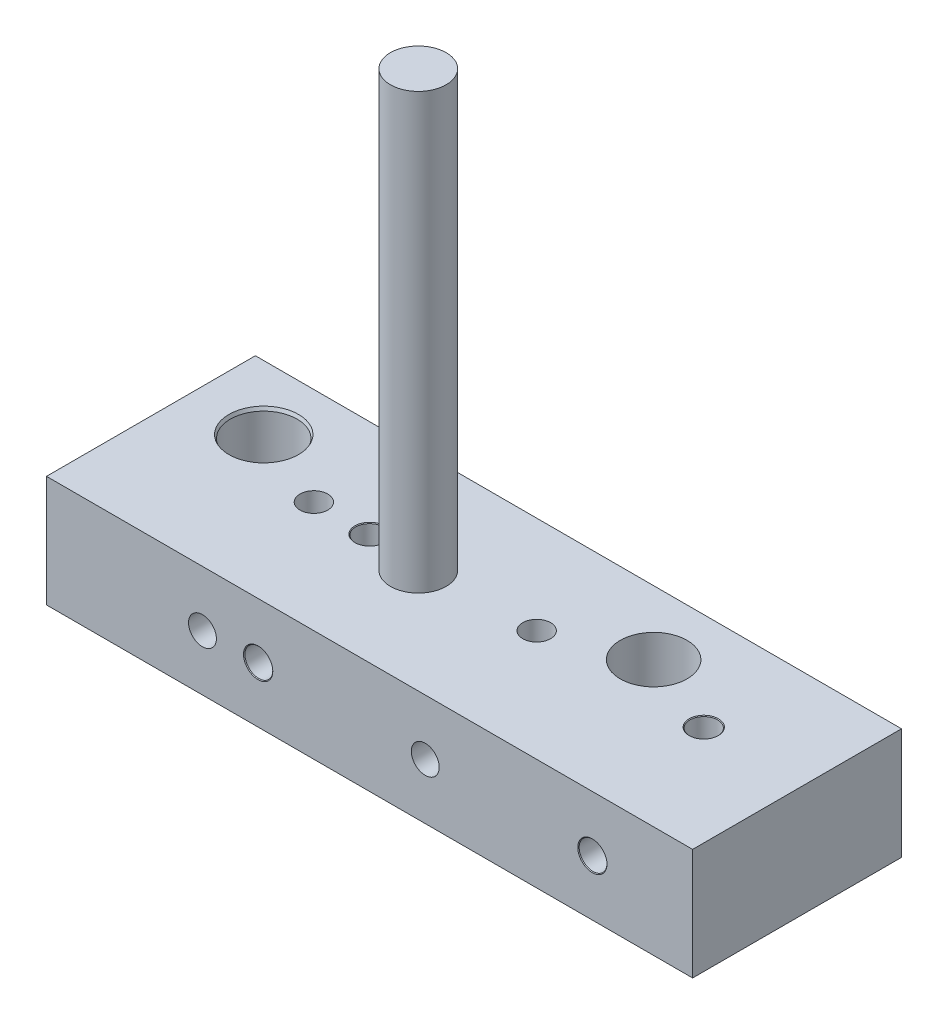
ISO-10303-21;
HEADER;
FILE_DESCRIPTION(('STEP AP214'),'2;1');
FILE_NAME('part.step','',(''),(''),'','','');
FILE_SCHEMA(('AUTOMOTIVE_DESIGN { 1 0 10303 214 1 1 1 1 }'));
ENDSEC;
DATA;
#1=APPLICATION_CONTEXT('core data for automotive mechanical design processes');
#2=APPLICATION_PROTOCOL_DEFINITION('international standard','automotive_design',2000,#1);
#3=PRODUCT_CONTEXT('',#1,'mechanical');
#4=PRODUCT('Part','Part','',(#3));
#5=PRODUCT_RELATED_PRODUCT_CATEGORY('part','',(#4));
#6=PRODUCT_DEFINITION_FORMATION('','',#4);
#7=PRODUCT_DEFINITION_CONTEXT('part definition',#1,'design');
#8=PRODUCT_DEFINITION('design','',#6,#7);
#9=PRODUCT_DEFINITION_SHAPE('','',#8);
#10=(LENGTH_UNIT() NAMED_UNIT(*) SI_UNIT(.MILLI.,.METRE.));
#11=(NAMED_UNIT(*) PLANE_ANGLE_UNIT() SI_UNIT($,.RADIAN.));
#12=(NAMED_UNIT(*) SI_UNIT($,.STERADIAN.) SOLID_ANGLE_UNIT());
#13=UNCERTAINTY_MEASURE_WITH_UNIT(LENGTH_MEASURE(1.E-05),#10,'distance_accuracy_value','');
#14=(GEOMETRIC_REPRESENTATION_CONTEXT(3) GLOBAL_UNCERTAINTY_ASSIGNED_CONTEXT((#13)) GLOBAL_UNIT_ASSIGNED_CONTEXT((#10,
#11,#12)) REPRESENTATION_CONTEXT('',''));
#15=CARTESIAN_POINT('',(0.,0.,0.));
#16=DIRECTION('',(0.,0.,1.));
#17=DIRECTION('',(1.,0.,0.));
#18=AXIS2_PLACEMENT_3D('',#15,#16,#17);
#19=CARTESIAN_POINT('',(0.,20.,-37.5));
#20=DIRECTION('',(0.,-1.,0.));
#21=DIRECTION('',(0.,0.,-1.));
#22=AXIS2_PLACEMENT_3D('',#19,#20,#21);
#23=PLANE('',#22);
#24=CARTESIAN_POINT('',(83.,20.,-26.));
#25=DIRECTION('',(0.,-1.,0.));
#26=DIRECTION('',(0.,0.,-1.));
#27=AXIS2_PLACEMENT_3D('',#24,#25,#26);
#28=CIRCLE('',#27,5.99999999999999);
#29=CARTESIAN_POINT('',(83.,20.,-32.));
#30=VERTEX_POINT('',#29);
#31=EDGE_CURVE('E9178',#30,#30,#28,.T.);
#32=ORIENTED_EDGE('',*,*,#31,.T.);
#33=EDGE_LOOP('',(#32));
#34=FACE_BOUND('',#33,.T.);
#35=DIRECTION('',(0.,0.,1.));
#36=VECTOR('',#35,1.);
#37=CARTESIAN_POINT('',(0.,20.,0.));
#38=LINE('',#37,#36);
#39=CARTESIAN_POINT('',(0.,20.,-37.5));
#40=VERTEX_POINT('',#39);
#41=CARTESIAN_POINT('',(0.,20.,0.));
#42=VERTEX_POINT('',#41);
#43=EDGE_CURVE('E9306',#40,#42,#38,.T.);
#44=ORIENTED_EDGE('',*,*,#43,.T.);
#45=DIRECTION('',(1.,0.,0.));
#46=VECTOR('',#45,1.);
#47=CARTESIAN_POINT('',(0.,20.,0.));
#48=LINE('',#47,#46);
#49=CARTESIAN_POINT('',(116.,20.,0.));
#50=VERTEX_POINT('',#49);
#51=EDGE_CURVE('E9304',#42,#50,#48,.T.);
#52=ORIENTED_EDGE('',*,*,#51,.T.);
#53=DIRECTION('',(0.,0.,-1.));
#54=VECTOR('',#53,1.);
#55=CARTESIAN_POINT('',(116.,20.,0.));
#56=LINE('',#55,#54);
#57=CARTESIAN_POINT('',(116.,20.,-37.5));
#58=VERTEX_POINT('',#57);
#59=EDGE_CURVE('E9302',#50,#58,#56,.T.);
#60=ORIENTED_EDGE('',*,*,#59,.T.);
#61=DIRECTION('',(-1.,0.,0.));
#62=VECTOR('',#61,1.);
#63=CARTESIAN_POINT('',(0.,20.,-37.5));
#64=LINE('',#63,#62);
#65=EDGE_CURVE('E9300',#58,#40,#64,.T.);
#66=ORIENTED_EDGE('',*,*,#65,.T.);
#67=EDGE_LOOP('',(#44,#52,#60,#66));
#68=FACE_BOUND('',#67,.T.);
#69=CARTESIAN_POINT('',(13.,20.,-26.));
#70=DIRECTION('',(0.,-1.,0.));
#71=DIRECTION('',(0.,0.,-1.));
#72=AXIS2_PLACEMENT_3D('',#69,#70,#71);
#73=CIRCLE('',#72,6.25);
#74=CARTESIAN_POINT('',(13.,20.,-32.25));
#75=VERTEX_POINT('',#74);
#76=EDGE_CURVE('E9327',#75,#75,#73,.T.);
#77=ORIENTED_EDGE('',*,*,#76,.T.);
#78=EDGE_LOOP('',(#77));
#79=FACE_BOUND('',#78,.T.);
#80=CARTESIAN_POINT('',(28.,20.,-20.));
#81=DIRECTION('',(0.,-1.,0.));
#82=DIRECTION('',(0.,0.,-1.));
#83=AXIS2_PLACEMENT_3D('',#80,#81,#82);
#84=CIRCLE('',#83,2.5);
#85=CARTESIAN_POINT('',(28.,20.,-22.5));
#86=VERTEX_POINT('',#85);
#87=EDGE_CURVE('E9333',#86,#86,#84,.T.);
#88=ORIENTED_EDGE('',*,*,#87,.T.);
#89=EDGE_LOOP('',(#88));
#90=FACE_BOUND('',#89,.T.);
#91=CARTESIAN_POINT('',(68.,20.,-20.));
#92=DIRECTION('',(0.,-1.,0.));
#93=DIRECTION('',(0.,0.,-1.));
#94=AXIS2_PLACEMENT_3D('',#91,#92,#93);
#95=CIRCLE('',#94,2.5);
#96=CARTESIAN_POINT('',(68.,20.,-22.5));
#97=VERTEX_POINT('',#96);
#98=EDGE_CURVE('E9339',#97,#97,#95,.T.);
#99=ORIENTED_EDGE('',*,*,#98,.T.);
#100=EDGE_LOOP('',(#99));
#101=FACE_BOUND('',#100,.T.);
#102=CARTESIAN_POINT('',(38.,20.,-20.));
#103=DIRECTION('',(0.,-1.,0.));
#104=DIRECTION('',(0.,0.,-1.));
#105=AXIS2_PLACEMENT_3D('',#102,#103,#104);
#106=CIRCLE('',#105,2.625);
#107=CARTESIAN_POINT('',(38.,20.,-22.625));
#108=VERTEX_POINT('',#107);
#109=EDGE_CURVE('E9351',#108,#108,#106,.T.);
#110=ORIENTED_EDGE('',*,*,#109,.T.);
#111=EDGE_LOOP('',(#110));
#112=FACE_BOUND('',#111,.T.);
#113=CARTESIAN_POINT('',(98.,20.,-20.));
#114=DIRECTION('',(0.,-1.,0.));
#115=DIRECTION('',(0.,0.,-1.));
#116=AXIS2_PLACEMENT_3D('',#113,#114,#115);
#117=CIRCLE('',#116,2.62499999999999);
#118=CARTESIAN_POINT('',(98.,20.,-22.625));
#119=VERTEX_POINT('',#118);
#120=EDGE_CURVE('E9363',#119,#119,#117,.T.);
#121=ORIENTED_EDGE('',*,*,#120,.T.);
#122=EDGE_LOOP('',(#121));
#123=FACE_BOUND('',#122,.T.);
#124=CARTESIAN_POINT('',(48.,20.,-18.75));
#125=DIRECTION('',(0.,-1.,0.));
#126=DIRECTION('',(0.,0.,-1.));
#127=AXIS2_PLACEMENT_3D('',#124,#125,#126);
#128=CIRCLE('',#127,5.);
#129=CARTESIAN_POINT('',(48.,20.,-23.75));
#130=VERTEX_POINT('',#129);
#131=EDGE_CURVE('E11',#130,#130,#128,.F.);
#132=ORIENTED_EDGE('',*,*,#131,.F.);
#133=EDGE_LOOP('',(#132));
#134=FACE_BOUND('',#133,.T.);
#135=ADVANCED_FACE('F9174',(#34,#68,#79,#90,#101,#112,#123,#134),#23,.F.);
#136=CARTESIAN_POINT('',(68.,0.,-20.));
#137=DIRECTION('',(0.,-1.,0.));
#138=DIRECTION('',(0.,0.,-1.));
#139=AXIS2_PLACEMENT_3D('',#136,#137,#138);
#140=CYLINDRICAL_SURFACE('',#139,2.5);
#141=CARTESIAN_POINT('',(68.,0.,-20.));
#142=DIRECTION('',(0.,-1.,0.));
#143=DIRECTION('',(0.,0.,-1.));
#144=AXIS2_PLACEMENT_3D('',#141,#142,#143);
#145=CIRCLE('',#144,2.49999999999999);
#146=CARTESIAN_POINT('',(68.,0.,-22.5));
#147=VERTEX_POINT('',#146);
#148=EDGE_CURVE('E9336',#147,#147,#145,.T.);
#149=ORIENTED_EDGE('',*,*,#148,.T.);
#150=EDGE_LOOP('',(#149));
#151=FACE_BOUND('',#150,.T.);
#152=CARTESIAN_POINT('',(68.,10.,-20.));
#153=DIRECTION('',(0.,-0.707106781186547,-0.707106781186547));
#154=DIRECTION('',(0.,-0.707106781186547,0.707106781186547));
#155=AXIS2_PLACEMENT_3D('',#152,#153,#154);
#156=ELLIPSE('',#155,3.53553390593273,2.49999999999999);
#157=CARTESIAN_POINT('',(65.5,10.,-20.));
#158=VERTEX_POINT('',#157);
#159=CARTESIAN_POINT('',(70.5,10.,-20.));
#160=VERTEX_POINT('',#159);
#161=EDGE_CURVE('E9189',#158,#160,#156,.F.);
#162=ORIENTED_EDGE('',*,*,#161,.T.);
#163=CARTESIAN_POINT('',(68.,10.,-20.));
#164=DIRECTION('',(0.,-0.707106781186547,0.707106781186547));
#165=DIRECTION('',(0.,-0.707106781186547,-0.707106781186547));
#166=AXIS2_PLACEMENT_3D('',#163,#164,#165);
#167=ELLIPSE('',#166,3.53553390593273,2.49999999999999);
#168=EDGE_CURVE('E9183',#160,#158,#167,.F.);
#169=ORIENTED_EDGE('',*,*,#168,.T.);
#170=EDGE_LOOP('',(#162,#169));
#171=FACE_BOUND('',#170,.T.);
#172=ADVANCED_FACE('F9252',(#151,#171),#140,.F.);
#173=CARTESIAN_POINT('',(28.,0.,-20.));
#174=DIRECTION('',(0.,-1.,0.));
#175=DIRECTION('',(0.,0.,-1.));
#176=AXIS2_PLACEMENT_3D('',#173,#174,#175);
#177=CYLINDRICAL_SURFACE('',#176,2.49999999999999);
#178=CARTESIAN_POINT('',(28.,0.,-20.));
#179=DIRECTION('',(0.,-1.,0.));
#180=DIRECTION('',(0.,0.,-1.));
#181=AXIS2_PLACEMENT_3D('',#178,#179,#180);
#182=CIRCLE('',#181,2.49999999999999);
#183=CARTESIAN_POINT('',(28.,0.,-22.5));
#184=VERTEX_POINT('',#183);
#185=EDGE_CURVE('E9330',#184,#184,#182,.T.);
#186=ORIENTED_EDGE('',*,*,#185,.T.);
#187=EDGE_LOOP('',(#186));
#188=FACE_BOUND('',#187,.T.);
#189=CARTESIAN_POINT('',(28.,10.,-20.));
#190=DIRECTION('',(0.,-0.707106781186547,-0.707106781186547));
#191=DIRECTION('',(0.,-0.707106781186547,0.707106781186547));
#192=AXIS2_PLACEMENT_3D('',#189,#190,#191);
#193=ELLIPSE('',#192,3.53553390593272,2.49999999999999);
#194=CARTESIAN_POINT('',(25.5,10.,-20.));
#195=VERTEX_POINT('',#194);
#196=CARTESIAN_POINT('',(30.5,10.,-20.));
#197=VERTEX_POINT('',#196);
#198=EDGE_CURVE('E9196',#195,#197,#193,.F.);
#199=ORIENTED_EDGE('',*,*,#198,.T.);
#200=CARTESIAN_POINT('',(28.,10.,-20.));
#201=DIRECTION('',(0.,-0.707106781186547,0.707106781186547));
#202=DIRECTION('',(0.,-0.707106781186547,-0.707106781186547));
#203=AXIS2_PLACEMENT_3D('',#200,#201,#202);
#204=ELLIPSE('',#203,3.53553390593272,2.49999999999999);
#205=EDGE_CURVE('E9250',#197,#195,#204,.F.);
#206=ORIENTED_EDGE('',*,*,#205,.T.);
#207=EDGE_LOOP('',(#199,#206));
#208=FACE_BOUND('',#207,.T.);
#209=ADVANCED_FACE('F9549',(#188,#208),#177,.F.);
#210=CARTESIAN_POINT('',(98.,0.,-20.));
#211=DIRECTION('',(0.,-1.,0.));
#212=DIRECTION('',(0.,0.,-1.));
#213=AXIS2_PLACEMENT_3D('',#210,#211,#212);
#214=CYLINDRICAL_SURFACE('',#213,2.5);
#215=CARTESIAN_POINT('',(98.,0.125000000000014,-20.));
#216=DIRECTION('',(0.,-1.,0.));
#217=DIRECTION('',(0.,0.,-1.));
#218=AXIS2_PLACEMENT_3D('',#215,#216,#217);
#219=CIRCLE('',#218,2.49999999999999);
#220=CARTESIAN_POINT('',(98.,0.125000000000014,-22.5));
#221=VERTEX_POINT('',#220);
#222=EDGE_CURVE('E9357',#221,#221,#219,.T.);
#223=ORIENTED_EDGE('',*,*,#222,.T.);
#224=EDGE_LOOP('',(#223));
#225=FACE_BOUND('',#224,.T.);
#226=CARTESIAN_POINT('',(98.,10.,-20.));
#227=DIRECTION('',(0.,-0.707106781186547,-0.707106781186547));
#228=DIRECTION('',(0.,-0.707106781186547,0.707106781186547));
#229=AXIS2_PLACEMENT_3D('',#226,#227,#228);
#230=ELLIPSE('',#229,3.53553390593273,2.5);
#231=CARTESIAN_POINT('',(95.5,10.,-20.));
#232=VERTEX_POINT('',#231);
#233=CARTESIAN_POINT('',(100.5,10.,-20.));
#234=VERTEX_POINT('',#233);
#235=EDGE_CURVE('E9275',#232,#234,#230,.F.);
#236=ORIENTED_EDGE('',*,*,#235,.T.);
#237=CARTESIAN_POINT('',(98.,10.,-20.));
#238=DIRECTION('',(0.,-0.707106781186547,0.707106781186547));
#239=DIRECTION('',(0.,-0.707106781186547,-0.707106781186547));
#240=AXIS2_PLACEMENT_3D('',#237,#238,#239);
#241=ELLIPSE('',#240,3.53553390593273,2.5);
#242=EDGE_CURVE('E9266',#234,#232,#241,.F.);
#243=ORIENTED_EDGE('',*,*,#242,.T.);
#244=EDGE_LOOP('',(#236,#243));
#245=FACE_BOUND('',#244,.T.);
#246=ADVANCED_FACE('F9525',(#225,#245),#214,.F.);
#247=CARTESIAN_POINT('',(38.,0.,-20.));
#248=DIRECTION('',(0.,-1.,0.));
#249=DIRECTION('',(0.,0.,-1.));
#250=AXIS2_PLACEMENT_3D('',#247,#248,#249);
#251=CYLINDRICAL_SURFACE('',#250,2.5);
#252=CARTESIAN_POINT('',(38.,0.125,-20.));
#253=DIRECTION('',(0.,-1.,0.));
#254=DIRECTION('',(0.,0.,-1.));
#255=AXIS2_PLACEMENT_3D('',#252,#253,#254);
#256=CIRCLE('',#255,2.5);
#257=CARTESIAN_POINT('',(38.,0.125,-22.5));
#258=VERTEX_POINT('',#257);
#259=EDGE_CURVE('E9345',#258,#258,#256,.T.);
#260=ORIENTED_EDGE('',*,*,#259,.T.);
#261=EDGE_LOOP('',(#260));
#262=FACE_BOUND('',#261,.T.);
#263=CARTESIAN_POINT('',(38.,10.,-20.));
#264=DIRECTION('',(0.,-0.707106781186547,-0.707106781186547));
#265=DIRECTION('',(0.,-0.707106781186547,0.707106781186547));
#266=AXIS2_PLACEMENT_3D('',#263,#264,#265);
#267=ELLIPSE('',#266,3.53553390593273,2.49999999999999);
#268=CARTESIAN_POINT('',(35.5,10.,-20.));
#269=VERTEX_POINT('',#268);
#270=CARTESIAN_POINT('',(40.5,10.,-20.));
#271=VERTEX_POINT('',#270);
#272=EDGE_CURVE('E9286',#269,#271,#267,.F.);
#273=ORIENTED_EDGE('',*,*,#272,.T.);
#274=CARTESIAN_POINT('',(38.,10.,-20.));
#275=DIRECTION('',(0.,-0.707106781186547,0.707106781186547));
#276=DIRECTION('',(0.,-0.707106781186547,-0.707106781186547));
#277=AXIS2_PLACEMENT_3D('',#274,#275,#276);
#278=ELLIPSE('',#277,3.53553390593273,2.49999999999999);
#279=EDGE_CURVE('E9277',#271,#269,#278,.F.);
#280=ORIENTED_EDGE('',*,*,#279,.T.);
#281=EDGE_LOOP('',(#273,#280));
#282=FACE_BOUND('',#281,.T.);
#283=ADVANCED_FACE('F9538',(#262,#282),#251,.F.);
#284=CARTESIAN_POINT('',(0.,20.,0.));
#285=DIRECTION('',(1.,0.,0.));
#286=DIRECTION('',(0.,0.,-1.));
#287=AXIS2_PLACEMENT_3D('',#284,#285,#286);
#288=PLANE('',#287);
#289=DIRECTION('',(0.,0.,1.));
#290=VECTOR('',#289,1.);
#291=CARTESIAN_POINT('',(0.,0.,0.));
#292=LINE('',#291,#290);
#293=CARTESIAN_POINT('',(0.,0.,-37.5));
#294=VERTEX_POINT('',#293);
#295=CARTESIAN_POINT('',(0.,0.,0.));
#296=VERTEX_POINT('',#295);
#297=EDGE_CURVE('E9315',#294,#296,#292,.T.);
#298=ORIENTED_EDGE('',*,*,#297,.T.);
#299=DIRECTION('',(0.,-1.,0.));
#300=VECTOR('',#299,1.);
#301=CARTESIAN_POINT('',(0.,20.,0.));
#302=LINE('',#301,#300);
#303=EDGE_CURVE('E9288',#42,#296,#302,.T.);
#304=ORIENTED_EDGE('',*,*,#303,.F.);
#305=ORIENTED_EDGE('',*,*,#43,.F.);
#306=DIRECTION('',(0.,-1.,0.));
#307=VECTOR('',#306,1.);
#308=CARTESIAN_POINT('',(0.,20.,-37.5));
#309=LINE('',#308,#307);
#310=EDGE_CURVE('E9297',#40,#294,#309,.T.);
#311=ORIENTED_EDGE('',*,*,#310,.T.);
#312=EDGE_LOOP('',(#298,#304,#305,#311));
#313=FACE_BOUND('',#312,.T.);
#314=ADVANCED_FACE('F9176',(#313),#288,.F.);
#315=CARTESIAN_POINT('',(0.,20.,0.));
#316=DIRECTION('',(0.,0.,-1.));
#317=DIRECTION('',(-1.,0.,0.));
#318=AXIS2_PLACEMENT_3D('',#315,#316,#317);
#319=PLANE('',#318);
#320=CARTESIAN_POINT('',(68.,10.,0.));
#321=DIRECTION('',(0.,0.,1.));
#322=DIRECTION('',(1.,0.,0.));
#323=AXIS2_PLACEMENT_3D('',#320,#321,#322);
#324=CIRCLE('',#323,2.49999999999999);
#325=CARTESIAN_POINT('',(70.5,10.,0.));
#326=VERTEX_POINT('',#325);
#327=EDGE_CURVE('E9396',#326,#326,#324,.T.);
#328=ORIENTED_EDGE('',*,*,#327,.F.);
#329=EDGE_LOOP('',(#328));
#330=FACE_BOUND('',#329,.T.);
#331=CARTESIAN_POINT('',(28.,10.,0.));
#332=DIRECTION('',(0.,0.,1.));
#333=DIRECTION('',(1.,0.,0.));
#334=AXIS2_PLACEMENT_3D('',#331,#332,#333);
#335=CIRCLE('',#334,2.49999999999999);
#336=CARTESIAN_POINT('',(30.5,10.,0.));
#337=VERTEX_POINT('',#336);
#338=EDGE_CURVE('E9390',#337,#337,#335,.T.);
#339=ORIENTED_EDGE('',*,*,#338,.F.);
#340=EDGE_LOOP('',(#339));
#341=FACE_BOUND('',#340,.T.);
#342=CARTESIAN_POINT('',(98.,10.,0.));
#343=DIRECTION('',(0.,0.,1.));
#344=DIRECTION('',(1.,0.,0.));
#345=AXIS2_PLACEMENT_3D('',#342,#343,#344);
#346=CIRCLE('',#345,2.625);
#347=CARTESIAN_POINT('',(100.625,10.,0.));
#348=VERTEX_POINT('',#347);
#349=EDGE_CURVE('E9378',#348,#348,#346,.T.);
#350=ORIENTED_EDGE('',*,*,#349,.F.);
#351=EDGE_LOOP('',(#350));
#352=FACE_BOUND('',#351,.T.);
#353=CARTESIAN_POINT('',(38.,10.,0.));
#354=DIRECTION('',(0.,0.,1.));
#355=DIRECTION('',(1.,0.,0.));
#356=AXIS2_PLACEMENT_3D('',#353,#354,#355);
#357=CIRCLE('',#356,2.625);
#358=CARTESIAN_POINT('',(40.625,10.,0.));
#359=VERTEX_POINT('',#358);
#360=EDGE_CURVE('E9366',#359,#359,#357,.T.);
#361=ORIENTED_EDGE('',*,*,#360,.F.);
#362=EDGE_LOOP('',(#361));
#363=FACE_BOUND('',#362,.T.);
#364=DIRECTION('',(1.,0.,0.));
#365=VECTOR('',#364,1.);
#366=CARTESIAN_POINT('',(0.,0.,0.));
#367=LINE('',#366,#365);
#368=CARTESIAN_POINT('',(116.,0.,0.));
#369=VERTEX_POINT('',#368);
#370=EDGE_CURVE('E9313',#296,#369,#367,.T.);
#371=ORIENTED_EDGE('',*,*,#370,.T.);
#372=DIRECTION('',(0.,-1.,0.));
#373=VECTOR('',#372,1.);
#374=CARTESIAN_POINT('',(116.,20.,0.));
#375=LINE('',#374,#373);
#376=EDGE_CURVE('E9291',#50,#369,#375,.T.);
#377=ORIENTED_EDGE('',*,*,#376,.F.);
#378=ORIENTED_EDGE('',*,*,#51,.F.);
#379=ORIENTED_EDGE('',*,*,#303,.T.);
#380=EDGE_LOOP('',(#371,#377,#378,#379));
#381=FACE_BOUND('',#380,.T.);
#382=ADVANCED_FACE('F9452',(#330,#341,#352,#363,#381),#319,.F.);
#383=CARTESIAN_POINT('',(116.,20.,0.));
#384=DIRECTION('',(-1.,0.,0.));
#385=DIRECTION('',(0.,0.,1.));
#386=AXIS2_PLACEMENT_3D('',#383,#384,#385);
#387=PLANE('',#386);
#388=DIRECTION('',(0.,0.,-1.));
#389=VECTOR('',#388,1.);
#390=CARTESIAN_POINT('',(116.,0.,0.));
#391=LINE('',#390,#389);
#392=CARTESIAN_POINT('',(116.,0.,-37.5));
#393=VERTEX_POINT('',#392);
#394=EDGE_CURVE('E9311',#369,#393,#391,.T.);
#395=ORIENTED_EDGE('',*,*,#394,.T.);
#396=DIRECTION('',(0.,-1.,0.));
#397=VECTOR('',#396,1.);
#398=CARTESIAN_POINT('',(116.,20.,-37.5));
#399=LINE('',#398,#397);
#400=EDGE_CURVE('E9294',#58,#393,#399,.T.);
#401=ORIENTED_EDGE('',*,*,#400,.F.);
#402=ORIENTED_EDGE('',*,*,#59,.F.);
#403=ORIENTED_EDGE('',*,*,#376,.T.);
#404=EDGE_LOOP('',(#395,#401,#402,#403));
#405=FACE_BOUND('',#404,.T.);
#406=ADVANCED_FACE('F9449',(#405),#387,.F.);
#407=CARTESIAN_POINT('',(0.,20.,-37.5));
#408=DIRECTION('',(0.,0.,1.));
#409=DIRECTION('',(1.,0.,0.));
#410=AXIS2_PLACEMENT_3D('',#407,#408,#409);
#411=PLANE('',#410);
#412=CARTESIAN_POINT('',(68.,10.,-37.5));
#413=DIRECTION('',(0.,0.,1.));
#414=DIRECTION('',(1.,0.,0.));
#415=AXIS2_PLACEMENT_3D('',#412,#413,#414);
#416=CIRCLE('',#415,2.49999999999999);
#417=CARTESIAN_POINT('',(70.5,10.,-37.5));
#418=VERTEX_POINT('',#417);
#419=EDGE_CURVE('E9399',#418,#418,#416,.T.);
#420=ORIENTED_EDGE('',*,*,#419,.T.);
#421=EDGE_LOOP('',(#420));
#422=FACE_BOUND('',#421,.T.);
#423=CARTESIAN_POINT('',(28.,10.,-37.5));
#424=DIRECTION('',(0.,0.,1.));
#425=DIRECTION('',(1.,0.,0.));
#426=AXIS2_PLACEMENT_3D('',#423,#424,#425);
#427=CIRCLE('',#426,2.49999999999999);
#428=CARTESIAN_POINT('',(30.5,10.,-37.5));
#429=VERTEX_POINT('',#428);
#430=EDGE_CURVE('E9393',#429,#429,#427,.T.);
#431=ORIENTED_EDGE('',*,*,#430,.T.);
#432=EDGE_LOOP('',(#431));
#433=FACE_BOUND('',#432,.T.);
#434=CARTESIAN_POINT('',(98.,10.,-37.5));
#435=DIRECTION('',(0.,0.,1.));
#436=DIRECTION('',(1.,0.,0.));
#437=AXIS2_PLACEMENT_3D('',#434,#435,#436);
#438=CIRCLE('',#437,2.62499999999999);
#439=CARTESIAN_POINT('',(100.625,10.,-37.5));
#440=VERTEX_POINT('',#439);
#441=EDGE_CURVE('E9387',#440,#440,#438,.T.);
#442=ORIENTED_EDGE('',*,*,#441,.T.);
#443=EDGE_LOOP('',(#442));
#444=FACE_BOUND('',#443,.T.);
#445=CARTESIAN_POINT('',(38.,10.,-37.5));
#446=DIRECTION('',(0.,0.,1.));
#447=DIRECTION('',(1.,0.,0.));
#448=AXIS2_PLACEMENT_3D('',#445,#446,#447);
#449=CIRCLE('',#448,2.62499999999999);
#450=CARTESIAN_POINT('',(40.625,10.,-37.5));
#451=VERTEX_POINT('',#450);
#452=EDGE_CURVE('E9375',#451,#451,#449,.T.);
#453=ORIENTED_EDGE('',*,*,#452,.T.);
#454=EDGE_LOOP('',(#453));
#455=FACE_BOUND('',#454,.T.);
#456=DIRECTION('',(-1.,0.,0.));
#457=VECTOR('',#456,1.);
#458=CARTESIAN_POINT('',(0.,0.,-37.5));
#459=LINE('',#458,#457);
#460=EDGE_CURVE('E9309',#393,#294,#459,.T.);
#461=ORIENTED_EDGE('',*,*,#460,.T.);
#462=ORIENTED_EDGE('',*,*,#310,.F.);
#463=ORIENTED_EDGE('',*,*,#65,.F.);
#464=ORIENTED_EDGE('',*,*,#400,.T.);
#465=EDGE_LOOP('',(#461,#462,#463,#464));
#466=FACE_BOUND('',#465,.T.);
#467=ADVANCED_FACE('F9425',(#422,#433,#444,#455,#466),#411,.F.);
#468=CARTESIAN_POINT('',(0.,0.,-37.5));
#469=DIRECTION('',(0.,-1.,0.));
#470=DIRECTION('',(0.,0.,-1.));
#471=AXIS2_PLACEMENT_3D('',#468,#469,#470);
#472=PLANE('',#471);
#473=CARTESIAN_POINT('',(83.,0.,-26.));
#474=DIRECTION('',(0.,-1.,0.));
#475=DIRECTION('',(0.,0.,-1.));
#476=AXIS2_PLACEMENT_3D('',#473,#474,#475);
#477=CIRCLE('',#476,6.25000000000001);
#478=CARTESIAN_POINT('',(83.,0.,-32.25));
#479=VERTEX_POINT('',#478);
#480=EDGE_CURVE('E9405',#479,#479,#477,.T.);
#481=ORIENTED_EDGE('',*,*,#480,.F.);
#482=EDGE_LOOP('',(#481));
#483=FACE_BOUND('',#482,.T.);
#484=CARTESIAN_POINT('',(98.,0.,-20.));
#485=DIRECTION('',(0.,-1.,0.));
#486=DIRECTION('',(0.,0.,-1.));
#487=AXIS2_PLACEMENT_3D('',#484,#485,#486);
#488=CIRCLE('',#487,2.625);
#489=CARTESIAN_POINT('',(98.,0.,-22.625));
#490=VERTEX_POINT('',#489);
#491=EDGE_CURVE('E9354',#490,#490,#488,.T.);
#492=ORIENTED_EDGE('',*,*,#491,.F.);
#493=EDGE_LOOP('',(#492));
#494=FACE_BOUND('',#493,.T.);
#495=CARTESIAN_POINT('',(38.,0.,-20.));
#496=DIRECTION('',(0.,-1.,0.));
#497=DIRECTION('',(0.,0.,-1.));
#498=AXIS2_PLACEMENT_3D('',#495,#496,#497);
#499=CIRCLE('',#498,2.625);
#500=CARTESIAN_POINT('',(38.,0.,-22.625));
#501=VERTEX_POINT('',#500);
#502=EDGE_CURVE('E9342',#501,#501,#499,.T.);
#503=ORIENTED_EDGE('',*,*,#502,.F.);
#504=EDGE_LOOP('',(#503));
#505=FACE_BOUND('',#504,.T.);
#506=ORIENTED_EDGE('',*,*,#148,.F.);
#507=EDGE_LOOP('',(#506));
#508=FACE_BOUND('',#507,.T.);
#509=ORIENTED_EDGE('',*,*,#185,.F.);
#510=EDGE_LOOP('',(#509));
#511=FACE_BOUND('',#510,.T.);
#512=CARTESIAN_POINT('',(13.,0.,-26.));
#513=DIRECTION('',(0.,-1.,0.));
#514=DIRECTION('',(0.,0.,-1.));
#515=AXIS2_PLACEMENT_3D('',#512,#513,#514);
#516=CIRCLE('',#515,6.25);
#517=CARTESIAN_POINT('',(13.,0.,-32.25));
#518=VERTEX_POINT('',#517);
#519=EDGE_CURVE('E9318',#518,#518,#516,.T.);
#520=ORIENTED_EDGE('',*,*,#519,.F.);
#521=EDGE_LOOP('',(#520));
#522=FACE_BOUND('',#521,.T.);
#523=ORIENTED_EDGE('',*,*,#297,.F.);
#524=ORIENTED_EDGE('',*,*,#460,.F.);
#525=ORIENTED_EDGE('',*,*,#394,.F.);
#526=ORIENTED_EDGE('',*,*,#370,.F.);
#527=EDGE_LOOP('',(#523,#524,#525,#526));
#528=FACE_BOUND('',#527,.T.);
#529=ADVANCED_FACE('F9421',(#483,#494,#505,#508,#511,#522,#528),#472,.T.);
#530=CARTESIAN_POINT('',(13.,0.,-26.));
#531=DIRECTION('',(0.,-1.,0.));
#532=DIRECTION('',(0.,0.,-1.));
#533=AXIS2_PLACEMENT_3D('',#530,#531,#532);
#534=CONICAL_SURFACE('',#533,6.25,0.392699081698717);
#535=CARTESIAN_POINT('',(13.,0.603553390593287,-26.));
#536=DIRECTION('',(0.,-1.,0.));
#537=DIRECTION('',(0.,0.,-1.));
#538=AXIS2_PLACEMENT_3D('',#535,#536,#537);
#539=CIRCLE('',#538,6.);
#540=CARTESIAN_POINT('',(13.,0.603553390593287,-32.));
#541=VERTEX_POINT('',#540);
#542=EDGE_CURVE('E9321',#541,#541,#539,.T.);
#543=ORIENTED_EDGE('',*,*,#542,.F.);
#544=EDGE_LOOP('',(#543));
#545=FACE_BOUND('',#544,.T.);
#546=ORIENTED_EDGE('',*,*,#519,.T.);
#547=EDGE_LOOP('',(#546));
#548=FACE_BOUND('',#547,.T.);
#549=ADVANCED_FACE('F9424',(#545,#548),#534,.F.);
#550=CARTESIAN_POINT('',(13.,0.,-26.));
#551=DIRECTION('',(0.,-1.,0.));
#552=DIRECTION('',(0.,0.,-1.));
#553=AXIS2_PLACEMENT_3D('',#550,#551,#552);
#554=CYLINDRICAL_SURFACE('',#553,6.);
#555=CARTESIAN_POINT('',(13.,19.3964466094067,-26.));
#556=DIRECTION('',(0.,-1.,0.));
#557=DIRECTION('',(0.,0.,-1.));
#558=AXIS2_PLACEMENT_3D('',#555,#556,#557);
#559=CIRCLE('',#558,5.99999999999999);
#560=CARTESIAN_POINT('',(13.,19.3964466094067,-32.));
#561=VERTEX_POINT('',#560);
#562=EDGE_CURVE('E9324',#561,#561,#559,.T.);
#563=ORIENTED_EDGE('',*,*,#562,.F.);
#564=EDGE_LOOP('',(#563));
#565=FACE_BOUND('',#564,.T.);
#566=ORIENTED_EDGE('',*,*,#542,.T.);
#567=EDGE_LOOP('',(#566));
#568=FACE_BOUND('',#567,.T.);
#569=ADVANCED_FACE('F9552',(#565,#568),#554,.F.);
#570=CARTESIAN_POINT('',(13.,19.3964466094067,-26.));
#571=DIRECTION('',(0.,1.,0.));
#572=DIRECTION('',(0.,0.,1.));
#573=AXIS2_PLACEMENT_3D('',#570,#571,#572);
#574=CONICAL_SURFACE('',#573,5.99999999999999,0.392699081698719);
#575=ORIENTED_EDGE('',*,*,#76,.F.);
#576=EDGE_LOOP('',(#575));
#577=FACE_BOUND('',#576,.T.);
#578=ORIENTED_EDGE('',*,*,#562,.T.);
#579=EDGE_LOOP('',(#578));
#580=FACE_BOUND('',#579,.T.);
#581=ADVANCED_FACE('F9547',(#577,#580),#574,.F.);
#582=CARTESIAN_POINT('',(28.,10.,-20.));
#583=DIRECTION('',(0.,-0.707106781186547,-0.707106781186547));
#584=DIRECTION('',(0.,-0.707106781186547,0.707106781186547));
#585=AXIS2_PLACEMENT_3D('',#582,#583,#584);
#586=ELLIPSE('',#585,3.53553390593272,2.49999999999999);
#587=EDGE_CURVE('E9262',#195,#197,#586,.T.);
#588=ORIENTED_EDGE('',*,*,#587,.T.);
#589=CARTESIAN_POINT('',(28.,10.,-20.));
#590=DIRECTION('',(0.,-0.707106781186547,0.707106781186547));
#591=DIRECTION('',(0.,-0.707106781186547,-0.707106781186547));
#592=AXIS2_PLACEMENT_3D('',#589,#590,#591);
#593=ELLIPSE('',#592,3.53553390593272,2.49999999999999);
#594=EDGE_CURVE('E9259',#197,#195,#593,.T.);
#595=ORIENTED_EDGE('',*,*,#594,.T.);
#596=EDGE_LOOP('',(#588,#595));
#597=FACE_BOUND('',#596,.T.);
#598=ORIENTED_EDGE('',*,*,#87,.F.);
#599=EDGE_LOOP('',(#598));
#600=FACE_BOUND('',#599,.T.);
#601=ADVANCED_FACE('F9544',(#597,#600),#177,.F.);
#602=CARTESIAN_POINT('',(68.,10.,-20.));
#603=DIRECTION('',(0.,-0.707106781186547,-0.707106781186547));
#604=DIRECTION('',(0.,-0.707106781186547,0.707106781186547));
#605=AXIS2_PLACEMENT_3D('',#602,#603,#604);
#606=ELLIPSE('',#605,3.53553390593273,2.49999999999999);
#607=EDGE_CURVE('E9242',#158,#160,#606,.T.);
#608=ORIENTED_EDGE('',*,*,#607,.T.);
#609=CARTESIAN_POINT('',(68.,10.,-20.));
#610=DIRECTION('',(0.,-0.707106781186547,0.707106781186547));
#611=DIRECTION('',(0.,-0.707106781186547,-0.707106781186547));
#612=AXIS2_PLACEMENT_3D('',#609,#610,#611);
#613=ELLIPSE('',#612,3.53553390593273,2.49999999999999);
#614=EDGE_CURVE('E9246',#160,#158,#613,.T.);
#615=ORIENTED_EDGE('',*,*,#614,.T.);
#616=EDGE_LOOP('',(#608,#615));
#617=FACE_BOUND('',#616,.T.);
#618=ORIENTED_EDGE('',*,*,#98,.F.);
#619=EDGE_LOOP('',(#618));
#620=FACE_BOUND('',#619,.T.);
#621=ADVANCED_FACE('F9254',(#617,#620),#140,.F.);
#622=CARTESIAN_POINT('',(38.,0.,-20.));
#623=DIRECTION('',(0.,-1.,0.));
#624=DIRECTION('',(0.,0.,-1.));
#625=AXIS2_PLACEMENT_3D('',#622,#623,#624);
#626=CONICAL_SURFACE('',#625,2.625,0.785398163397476);
#627=ORIENTED_EDGE('',*,*,#259,.F.);
#628=EDGE_LOOP('',(#627));
#629=FACE_BOUND('',#628,.T.);
#630=ORIENTED_EDGE('',*,*,#502,.T.);
#631=EDGE_LOOP('',(#630));
#632=FACE_BOUND('',#631,.T.);
#633=ADVANCED_FACE('F9536',(#629,#632),#626,.F.);
#634=CARTESIAN_POINT('',(38.,10.,-20.));
#635=DIRECTION('',(0.,-0.707106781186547,-0.707106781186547));
#636=DIRECTION('',(0.,-0.707106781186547,0.707106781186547));
#637=AXIS2_PLACEMENT_3D('',#634,#635,#636);
#638=ELLIPSE('',#637,3.53553390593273,2.49999999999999);
#639=EDGE_CURVE('E9283',#269,#271,#638,.T.);
#640=ORIENTED_EDGE('',*,*,#639,.T.);
#641=CARTESIAN_POINT('',(38.,10.,-20.));
#642=DIRECTION('',(0.,-0.707106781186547,0.707106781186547));
#643=DIRECTION('',(0.,-0.707106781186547,-0.707106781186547));
#644=AXIS2_PLACEMENT_3D('',#641,#642,#643);
#645=ELLIPSE('',#644,3.53553390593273,2.49999999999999);
#646=EDGE_CURVE('E9280',#271,#269,#645,.T.);
#647=ORIENTED_EDGE('',*,*,#646,.T.);
#648=EDGE_LOOP('',(#640,#647));
#649=FACE_BOUND('',#648,.T.);
#650=CARTESIAN_POINT('',(38.,19.875,-20.));
#651=DIRECTION('',(0.,-1.,0.));
#652=DIRECTION('',(0.,0.,-1.));
#653=AXIS2_PLACEMENT_3D('',#650,#651,#652);
#654=CIRCLE('',#653,2.5);
#655=CARTESIAN_POINT('',(38.,19.875,-22.5));
#656=VERTEX_POINT('',#655);
#657=EDGE_CURVE('E9348',#656,#656,#654,.T.);
#658=ORIENTED_EDGE('',*,*,#657,.F.);
#659=EDGE_LOOP('',(#658));
#660=FACE_BOUND('',#659,.T.);
#661=ADVANCED_FACE('F9532',(#649,#660),#251,.F.);
#662=CARTESIAN_POINT('',(38.,19.875,-20.));
#663=DIRECTION('',(0.,1.,0.));
#664=DIRECTION('',(0.,0.,1.));
#665=AXIS2_PLACEMENT_3D('',#662,#663,#664);
#666=CONICAL_SURFACE('',#665,2.5,0.785398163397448);
#667=ORIENTED_EDGE('',*,*,#109,.F.);
#668=EDGE_LOOP('',(#667));
#669=FACE_BOUND('',#668,.T.);
#670=ORIENTED_EDGE('',*,*,#657,.T.);
#671=EDGE_LOOP('',(#670));
#672=FACE_BOUND('',#671,.T.);
#673=ADVANCED_FACE('F9528',(#669,#672),#666,.F.);
#674=CARTESIAN_POINT('',(98.,0.,-20.));
#675=DIRECTION('',(0.,-1.,0.));
#676=DIRECTION('',(0.,0.,-1.));
#677=AXIS2_PLACEMENT_3D('',#674,#675,#676);
#678=CONICAL_SURFACE('',#677,2.625,0.785398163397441);
#679=ORIENTED_EDGE('',*,*,#222,.F.);
#680=EDGE_LOOP('',(#679));
#681=FACE_BOUND('',#680,.T.);
#682=ORIENTED_EDGE('',*,*,#491,.T.);
#683=EDGE_LOOP('',(#682));
#684=FACE_BOUND('',#683,.T.);
#685=ADVANCED_FACE('F9523',(#681,#684),#678,.F.);
#686=CARTESIAN_POINT('',(98.,10.,-20.));
#687=DIRECTION('',(0.,-0.707106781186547,-0.707106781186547));
#688=DIRECTION('',(0.,-0.707106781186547,0.707106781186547));
#689=AXIS2_PLACEMENT_3D('',#686,#687,#688);
#690=ELLIPSE('',#689,3.53553390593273,2.5);
#691=EDGE_CURVE('E9272',#232,#234,#690,.T.);
#692=ORIENTED_EDGE('',*,*,#691,.T.);
#693=CARTESIAN_POINT('',(98.,10.,-20.));
#694=DIRECTION('',(0.,-0.707106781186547,0.707106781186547));
#695=DIRECTION('',(0.,-0.707106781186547,-0.707106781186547));
#696=AXIS2_PLACEMENT_3D('',#693,#694,#695);
#697=ELLIPSE('',#696,3.53553390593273,2.5);
#698=EDGE_CURVE('E9269',#234,#232,#697,.T.);
#699=ORIENTED_EDGE('',*,*,#698,.T.);
#700=EDGE_LOOP('',(#692,#699));
#701=FACE_BOUND('',#700,.T.);
#702=CARTESIAN_POINT('',(98.,19.875,-20.));
#703=DIRECTION('',(0.,-1.,0.));
#704=DIRECTION('',(0.,0.,-1.));
#705=AXIS2_PLACEMENT_3D('',#702,#703,#704);
#706=CIRCLE('',#705,2.5);
#707=CARTESIAN_POINT('',(98.,19.875,-22.5));
#708=VERTEX_POINT('',#707);
#709=EDGE_CURVE('E9360',#708,#708,#706,.T.);
#710=ORIENTED_EDGE('',*,*,#709,.F.);
#711=EDGE_LOOP('',(#710));
#712=FACE_BOUND('',#711,.T.);
#713=ADVANCED_FACE('F9519',(#701,#712),#214,.F.);
#714=CARTESIAN_POINT('',(98.,19.875,-20.));
#715=DIRECTION('',(0.,1.,0.));
#716=DIRECTION('',(0.,0.,1.));
#717=AXIS2_PLACEMENT_3D('',#714,#715,#716);
#718=CONICAL_SURFACE('',#717,2.5,0.785398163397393);
#719=ORIENTED_EDGE('',*,*,#120,.F.);
#720=EDGE_LOOP('',(#719));
#721=FACE_BOUND('',#720,.T.);
#722=ORIENTED_EDGE('',*,*,#709,.T.);
#723=EDGE_LOOP('',(#722));
#724=FACE_BOUND('',#723,.T.);
#725=ADVANCED_FACE('F9516',(#721,#724),#718,.F.);
#726=CARTESIAN_POINT('',(38.,10.,0.));
#727=DIRECTION('',(0.,0.,1.));
#728=DIRECTION('',(1.,0.,0.));
#729=AXIS2_PLACEMENT_3D('',#726,#727,#728);
#730=CYLINDRICAL_SURFACE('',#729,2.49999999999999);
#731=CARTESIAN_POINT('',(38.,10.,-0.125000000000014));
#732=DIRECTION('',(0.,0.,1.));
#733=DIRECTION('',(1.,0.,0.));
#734=AXIS2_PLACEMENT_3D('',#731,#732,#733);
#735=CIRCLE('',#734,2.49999999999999);
#736=CARTESIAN_POINT('',(40.5,10.,-0.125000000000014));
#737=VERTEX_POINT('',#736);
#738=EDGE_CURVE('E9369',#737,#737,#735,.T.);
#739=ORIENTED_EDGE('',*,*,#738,.T.);
#740=EDGE_LOOP('',(#739));
#741=FACE_BOUND('',#740,.T.);
#742=ORIENTED_EDGE('',*,*,#272,.F.);
#743=ORIENTED_EDGE('',*,*,#646,.F.);
#744=EDGE_LOOP('',(#742,#743));
#745=FACE_BOUND('',#744,.T.);
#746=ADVANCED_FACE('F9512',(#741,#745),#730,.F.);
#747=CARTESIAN_POINT('',(38.,10.,0.));
#748=DIRECTION('',(0.,0.,1.));
#749=DIRECTION('',(1.,0.,0.));
#750=AXIS2_PLACEMENT_3D('',#747,#748,#749);
#751=CONICAL_SURFACE('',#750,2.625,0.785398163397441);
#752=ORIENTED_EDGE('',*,*,#738,.F.);
#753=EDGE_LOOP('',(#752));
#754=FACE_BOUND('',#753,.T.);
#755=ORIENTED_EDGE('',*,*,#360,.T.);
#756=EDGE_LOOP('',(#755));
#757=FACE_BOUND('',#756,.T.);
#758=ADVANCED_FACE('F9510',(#754,#757),#751,.F.);
#759=CARTESIAN_POINT('',(38.,10.,-37.375));
#760=DIRECTION('',(0.,0.,1.));
#761=DIRECTION('',(1.,0.,0.));
#762=AXIS2_PLACEMENT_3D('',#759,#760,#761);
#763=CIRCLE('',#762,2.5);
#764=CARTESIAN_POINT('',(40.5,10.,-37.375));
#765=VERTEX_POINT('',#764);
#766=EDGE_CURVE('E9372',#765,#765,#763,.T.);
#767=ORIENTED_EDGE('',*,*,#766,.F.);
#768=EDGE_LOOP('',(#767));
#769=FACE_BOUND('',#768,.T.);
#770=ORIENTED_EDGE('',*,*,#639,.F.);
#771=ORIENTED_EDGE('',*,*,#279,.F.);
#772=EDGE_LOOP('',(#770,#771));
#773=FACE_BOUND('',#772,.T.);
#774=ADVANCED_FACE('F9506',(#769,#773),#730,.F.);
#775=CARTESIAN_POINT('',(38.,10.,-37.375));
#776=DIRECTION('',(0.,0.,-1.));
#777=DIRECTION('',(-1.,0.,0.));
#778=AXIS2_PLACEMENT_3D('',#775,#776,#777);
#779=CONICAL_SURFACE('',#778,2.5,0.785398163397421);
#780=ORIENTED_EDGE('',*,*,#452,.F.);
#781=EDGE_LOOP('',(#780));
#782=FACE_BOUND('',#781,.T.);
#783=ORIENTED_EDGE('',*,*,#766,.T.);
#784=EDGE_LOOP('',(#783));
#785=FACE_BOUND('',#784,.T.);
#786=ADVANCED_FACE('F9503',(#782,#785),#779,.F.);
#787=CARTESIAN_POINT('',(98.,10.,0.));
#788=DIRECTION('',(0.,0.,1.));
#789=DIRECTION('',(1.,0.,0.));
#790=AXIS2_PLACEMENT_3D('',#787,#788,#789);
#791=CYLINDRICAL_SURFACE('',#790,2.5);
#792=CARTESIAN_POINT('',(98.,10.,-0.125000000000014));
#793=DIRECTION('',(0.,0.,1.));
#794=DIRECTION('',(1.,0.,0.));
#795=AXIS2_PLACEMENT_3D('',#792,#793,#794);
#796=CIRCLE('',#795,2.49999999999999);
#797=CARTESIAN_POINT('',(100.5,10.,-0.125000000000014));
#798=VERTEX_POINT('',#797);
#799=EDGE_CURVE('E9381',#798,#798,#796,.T.);
#800=ORIENTED_EDGE('',*,*,#799,.T.);
#801=EDGE_LOOP('',(#800));
#802=FACE_BOUND('',#801,.T.);
#803=ORIENTED_EDGE('',*,*,#235,.F.);
#804=ORIENTED_EDGE('',*,*,#698,.F.);
#805=EDGE_LOOP('',(#803,#804));
#806=FACE_BOUND('',#805,.T.);
#807=ADVANCED_FACE('F9499',(#802,#806),#791,.F.);
#808=CARTESIAN_POINT('',(98.,10.,0.));
#809=DIRECTION('',(0.,0.,1.));
#810=DIRECTION('',(1.,0.,0.));
#811=AXIS2_PLACEMENT_3D('',#808,#809,#810);
#812=CONICAL_SURFACE('',#811,2.625,0.785398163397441);
#813=ORIENTED_EDGE('',*,*,#799,.F.);
#814=EDGE_LOOP('',(#813));
#815=FACE_BOUND('',#814,.T.);
#816=ORIENTED_EDGE('',*,*,#349,.T.);
#817=EDGE_LOOP('',(#816));
#818=FACE_BOUND('',#817,.T.);
#819=ADVANCED_FACE('F9497',(#815,#818),#812,.F.);
#820=CARTESIAN_POINT('',(98.,10.,-37.375));
#821=DIRECTION('',(0.,0.,1.));
#822=DIRECTION('',(1.,0.,0.));
#823=AXIS2_PLACEMENT_3D('',#820,#821,#822);
#824=CIRCLE('',#823,2.5);
#825=CARTESIAN_POINT('',(100.5,10.,-37.375));
#826=VERTEX_POINT('',#825);
#827=EDGE_CURVE('E9384',#826,#826,#824,.T.);
#828=ORIENTED_EDGE('',*,*,#827,.F.);
#829=EDGE_LOOP('',(#828));
#830=FACE_BOUND('',#829,.T.);
#831=ORIENTED_EDGE('',*,*,#691,.F.);
#832=ORIENTED_EDGE('',*,*,#242,.F.);
#833=EDGE_LOOP('',(#831,#832));
#834=FACE_BOUND('',#833,.T.);
#835=ADVANCED_FACE('F9493',(#830,#834),#791,.F.);
#836=CARTESIAN_POINT('',(98.,10.,-37.375));
#837=DIRECTION('',(0.,0.,-1.));
#838=DIRECTION('',(-1.,0.,0.));
#839=AXIS2_PLACEMENT_3D('',#836,#837,#838);
#840=CONICAL_SURFACE('',#839,2.5,0.785398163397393);
#841=ORIENTED_EDGE('',*,*,#441,.F.);
#842=EDGE_LOOP('',(#841));
#843=FACE_BOUND('',#842,.T.);
#844=ORIENTED_EDGE('',*,*,#827,.T.);
#845=EDGE_LOOP('',(#844));
#846=FACE_BOUND('',#845,.T.);
#847=ADVANCED_FACE('F9490',(#843,#846),#840,.F.);
#848=CARTESIAN_POINT('',(28.,10.,0.));
#849=DIRECTION('',(0.,0.,1.));
#850=DIRECTION('',(1.,0.,0.));
#851=AXIS2_PLACEMENT_3D('',#848,#849,#850);
#852=CYLINDRICAL_SURFACE('',#851,2.49999999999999);
#853=ORIENTED_EDGE('',*,*,#338,.T.);
#854=EDGE_LOOP('',(#853));
#855=FACE_BOUND('',#854,.T.);
#856=ORIENTED_EDGE('',*,*,#198,.F.);
#857=ORIENTED_EDGE('',*,*,#594,.F.);
#858=EDGE_LOOP('',(#856,#857));
#859=FACE_BOUND('',#858,.T.);
#860=ADVANCED_FACE('F9488',(#855,#859),#852,.F.);
#861=ORIENTED_EDGE('',*,*,#430,.F.);
#862=EDGE_LOOP('',(#861));
#863=FACE_BOUND('',#862,.T.);
#864=ORIENTED_EDGE('',*,*,#587,.F.);
#865=ORIENTED_EDGE('',*,*,#205,.F.);
#866=EDGE_LOOP('',(#864,#865));
#867=FACE_BOUND('',#866,.T.);
#868=ADVANCED_FACE('F9485',(#863,#867),#852,.F.);
#869=CARTESIAN_POINT('',(68.,10.,0.));
#870=DIRECTION('',(0.,0.,1.));
#871=DIRECTION('',(1.,0.,0.));
#872=AXIS2_PLACEMENT_3D('',#869,#870,#871);
#873=CYLINDRICAL_SURFACE('',#872,2.49999999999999);
#874=ORIENTED_EDGE('',*,*,#327,.T.);
#875=EDGE_LOOP('',(#874));
#876=FACE_BOUND('',#875,.T.);
#877=ORIENTED_EDGE('',*,*,#161,.F.);
#878=ORIENTED_EDGE('',*,*,#614,.F.);
#879=EDGE_LOOP('',(#877,#878));
#880=FACE_BOUND('',#879,.T.);
#881=ADVANCED_FACE('F9249',(#876,#880),#873,.F.);
#882=ORIENTED_EDGE('',*,*,#419,.F.);
#883=EDGE_LOOP('',(#882));
#884=FACE_BOUND('',#883,.T.);
#885=ORIENTED_EDGE('',*,*,#607,.F.);
#886=ORIENTED_EDGE('',*,*,#168,.F.);
#887=EDGE_LOOP('',(#885,#886));
#888=FACE_BOUND('',#887,.T.);
#889=ADVANCED_FACE('F9243',(#884,#888),#873,.F.);
#890=CARTESIAN_POINT('',(48.,98.,-18.75));
#891=DIRECTION('',(0.,-1.,0.));
#892=DIRECTION('',(0.,0.,-1.));
#893=AXIS2_PLACEMENT_3D('',#890,#891,#892);
#894=CYLINDRICAL_SURFACE('',#893,5.);
#895=CARTESIAN_POINT('',(48.,98.,-18.75));
#896=DIRECTION('',(0.,1.,0.));
#897=DIRECTION('',(0.,0.,1.));
#898=AXIS2_PLACEMENT_3D('',#895,#896,#897);
#899=CIRCLE('',#898,5.);
#900=CARTESIAN_POINT('',(48.,98.,-13.75));
#901=VERTEX_POINT('',#900);
#902=EDGE_CURVE('E9402',#901,#901,#899,.T.);
#903=ORIENTED_EDGE('',*,*,#902,.F.);
#904=EDGE_LOOP('',(#903));
#905=FACE_BOUND('',#904,.T.);
#906=ORIENTED_EDGE('',*,*,#131,.T.);
#907=EDGE_LOOP('',(#906));
#908=FACE_BOUND('',#907,.T.);
#909=ADVANCED_FACE('F9470',(#905,#908),#894,.T.);
#910=CARTESIAN_POINT('',(48.,98.,-18.75));
#911=DIRECTION('',(0.,1.,0.));
#912=DIRECTION('',(0.,0.,1.));
#913=AXIS2_PLACEMENT_3D('',#910,#911,#912);
#914=PLANE('',#913);
#915=ORIENTED_EDGE('',*,*,#902,.T.);
#916=EDGE_LOOP('',(#915));
#917=FACE_BOUND('',#916,.T.);
#918=ADVANCED_FACE('F9472',(#917),#914,.T.);
#919=CARTESIAN_POINT('',(83.,0.,-26.));
#920=DIRECTION('',(0.,-1.,0.));
#921=DIRECTION('',(0.,0.,-1.));
#922=AXIS2_PLACEMENT_3D('',#919,#920,#921);
#923=CYLINDRICAL_SURFACE('',#922,5.99999999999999);
#924=CARTESIAN_POINT('',(83.,0.603553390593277,-26.));
#925=DIRECTION('',(0.,-1.,0.));
#926=DIRECTION('',(0.,0.,-1.));
#927=AXIS2_PLACEMENT_3D('',#924,#925,#926);
#928=CIRCLE('',#927,6.00000000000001);
#929=CARTESIAN_POINT('',(83.,0.603553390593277,-32.));
#930=VERTEX_POINT('',#929);
#931=EDGE_CURVE('E9408',#930,#930,#928,.T.);
#932=ORIENTED_EDGE('',*,*,#931,.T.);
#933=EDGE_LOOP('',(#932));
#934=FACE_BOUND('',#933,.T.);
#935=ORIENTED_EDGE('',*,*,#31,.F.);
#936=EDGE_LOOP('',(#935));
#937=FACE_BOUND('',#936,.T.);
#938=ADVANCED_FACE('F9412',(#934,#937),#923,.F.);
#939=CARTESIAN_POINT('',(83.,0.,-26.));
#940=DIRECTION('',(0.,-1.,0.));
#941=DIRECTION('',(0.,0.,-1.));
#942=AXIS2_PLACEMENT_3D('',#939,#940,#941);
#943=CONICAL_SURFACE('',#942,6.25000000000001,0.392699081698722);
#944=ORIENTED_EDGE('',*,*,#931,.F.);
#945=EDGE_LOOP('',(#944));
#946=FACE_BOUND('',#945,.T.);
#947=ORIENTED_EDGE('',*,*,#480,.T.);
#948=EDGE_LOOP('',(#947));
#949=FACE_BOUND('',#948,.T.);
#950=ADVANCED_FACE('F9415',(#946,#949),#943,.F.);
#951=CLOSED_SHELL('',(#135,#172,#209,#246,#283,#314,#382,#406,#467,#529,#549,#569,#581,#601,
#621,#633,#661,#673,#685,#713,#725,#746,#758,#774,#786,#807,#819,#835,#847,#860,#868,#881,#889,
#909,#918,#938,#950));
#952=MANIFOLD_SOLID_BREP('B2',#951);
#953=ADVANCED_BREP_SHAPE_REPRESENTATION('',(#18,#952),#14);
#954=SHAPE_DEFINITION_REPRESENTATION(#9,#953);
ENDSEC;
END-ISO-10303-21;
